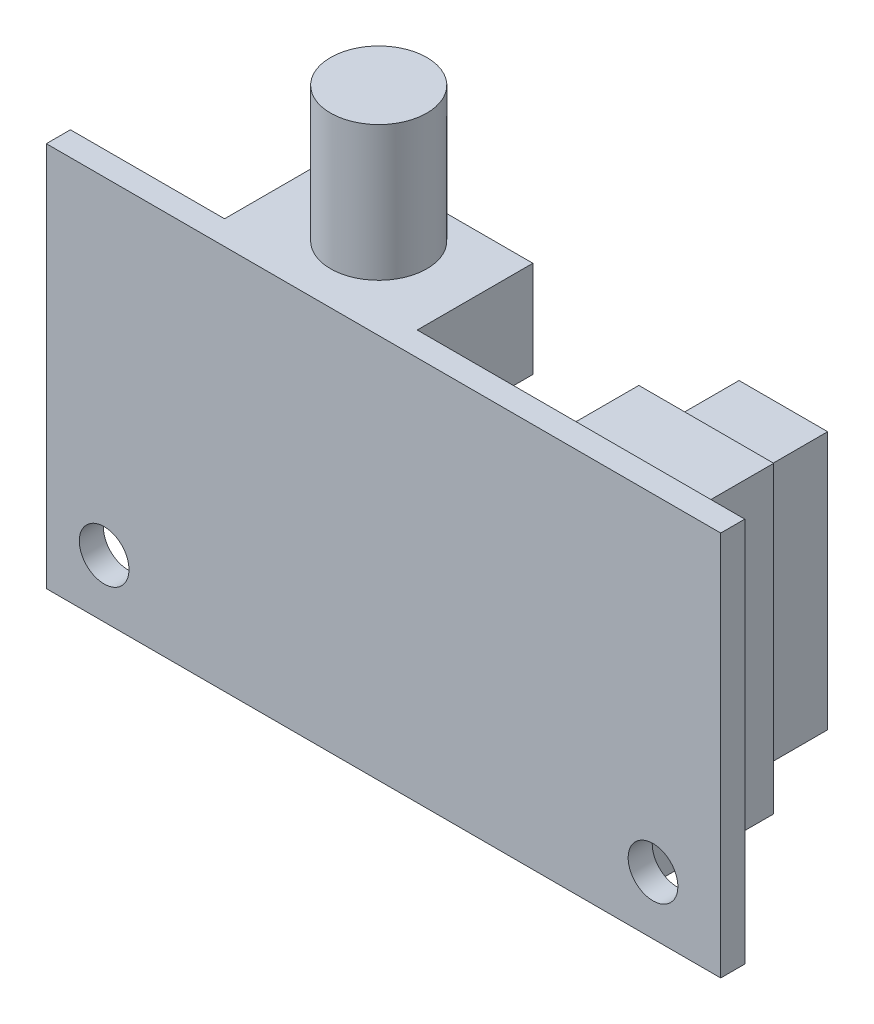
from build123d import *

# Parameters (mm, degrees)
SKETCH1_W            = 11.770759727
SKETCH1_H            = 17.490127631
PCB_CONTROLLER_DEPTH = 1.5875
SKETCH6_W            = 44.45
SKETCH6_H            = 25.4
REF_PCB_DEPTH        = 1.5875
SKETCH7_R            = 1.6383
REF_HOLES_DEPTH      = 52.861465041
SKETCH9_W            = 12.7
SKETCH9_H            = 6.35
EXTRUDE7_DEPTH       = 7.62
SKETCH4_R            = 3.175
EXTRUDE8_DEPTH       = 8.89
SKETCH19_W           = 8.89
SKETCH19_H           = 20.0152
EXTRUDE15_DEPTH      = 9.525
SKETCH18_W           = 5.842
SKETCH18_H           = 17.018
EXTRUDE17_DEPTH      = 5.08


with BuildPart() as part:
    # Sketch1 → PCB-Controller (new body)
    with BuildSketch(Plane.XY):
        with Locations((-5.885379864, 16.591504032)):
            Rectangle(SKETCH1_W, SKETCH1_H)
    extrude(amount=-PCB_CONTROLLER_DEPTH)

    # Sketch6 → Ref PCB (add)
    with BuildSketch(Plane(origin=(0, 0, 0), x_dir=(-1, 0, 0), z_dir=(0, 0, -1))):
        with Locations((22.225, 12.7)):
            Rectangle(SKETCH6_W, SKETCH6_H)
    extrude(amount=REF_PCB_DEPTH)

    # Sketch7 → Ref holes (cut, through all)
    with BuildSketch(Plane(origin=(0, -1.27, 0), x_dir=(-1, 0, 0), z_dir=(0, 0, -1))):
        with Locations((4.463870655, 5.08)):
            Circle(SKETCH7_R)
        with Locations((40.64, 5.08)):
            Circle(SKETCH7_R)
    extrude(amount=REF_HOLES_DEPTH, mode=Mode.SUBTRACT)

    # Sketch9 → Extrude7 (add)
    with BuildSketch(Plane(origin=(0, 0, -1.5875), x_dir=(-1, 0, 0), z_dir=(0, 0, -1))):
        with Locations((27.94, 22.225)):
            Rectangle(SKETCH9_W, SKETCH9_H)
    extrude(amount=EXTRUDE7_DEPTH)

    # Sketch4 → Extrude8 (add)
    with BuildSketch(Plane(origin=(0, 25.4, 0), x_dir=(-1, 0, 0), z_dir=(0, 1, 0))):
        with Locations(Location((27.94, -5.3975, 0), (0, 0, 270))):
            Circle(SKETCH4_R)
    extrude(amount=EXTRUDE8_DEPTH)

    # Sketch19 → Extrude15 (add)
    with BuildSketch(Plane(origin=(0, 0, -1.5875), x_dir=(-1, 0, 0), z_dir=(0, 0, -1))):
        with Locations((12.065, 10.0076)):
            Rectangle(SKETCH19_W, SKETCH19_H)
    extrude(amount=EXTRUDE15_DEPTH)

    # Sketch18 → Extrude17 (add)
    with BuildSketch(Plane(origin=(0, 0, -11.1125), x_dir=(-1, 0, 0), z_dir=(0, 0, -1))):
        with Locations((12.065, 10.0076)):
            Rectangle(SKETCH18_W, SKETCH18_H)
    extrude(amount=EXTRUDE17_DEPTH)


solid = part.part
